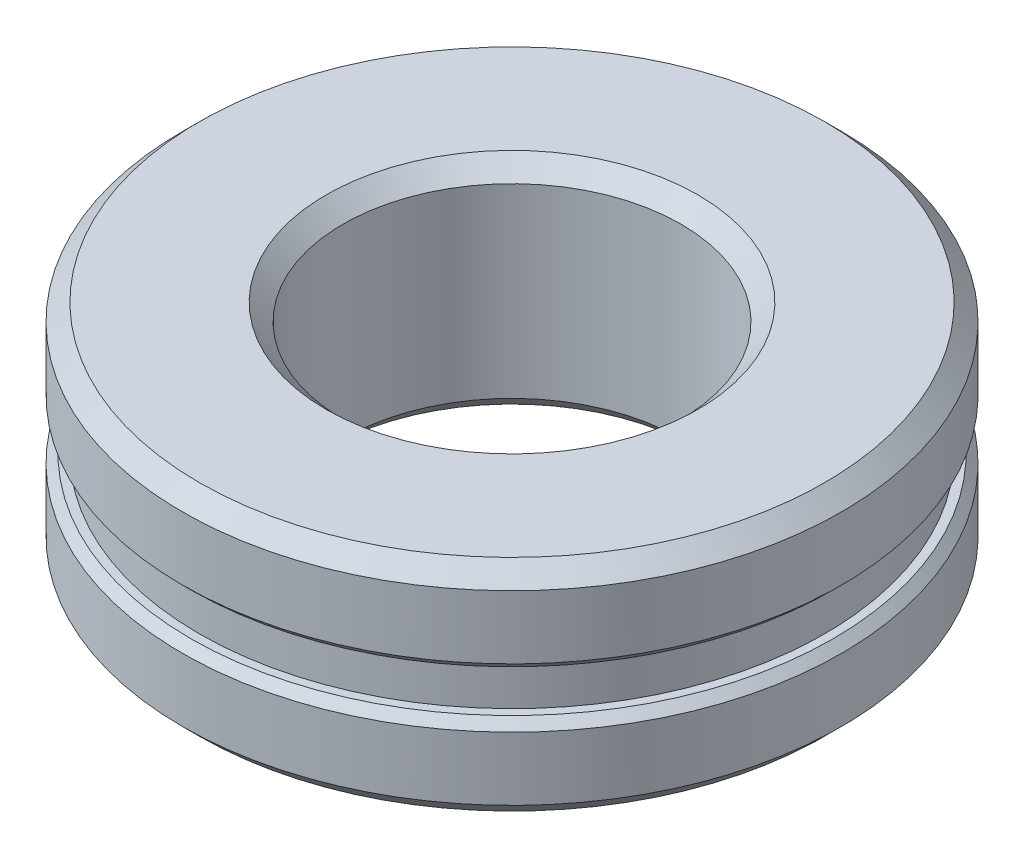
ISO-10303-21;
HEADER;
FILE_DESCRIPTION(('STEP AP214'),'2;1');
FILE_NAME('part.step','',(''),(''),'','','');
FILE_SCHEMA(('AUTOMOTIVE_DESIGN { 1 0 10303 214 1 1 1 1 }'));
ENDSEC;
DATA;
#1=APPLICATION_CONTEXT('core data for automotive mechanical design processes');
#2=APPLICATION_PROTOCOL_DEFINITION('international standard','automotive_design',2000,#1);
#3=PRODUCT_CONTEXT('',#1,'mechanical');
#4=PRODUCT('Part','Part','',(#3));
#5=PRODUCT_RELATED_PRODUCT_CATEGORY('part','',(#4));
#6=PRODUCT_DEFINITION_FORMATION('','',#4);
#7=PRODUCT_DEFINITION_CONTEXT('part definition',#1,'design');
#8=PRODUCT_DEFINITION('design','',#6,#7);
#9=PRODUCT_DEFINITION_SHAPE('','',#8);
#10=(LENGTH_UNIT() NAMED_UNIT(*) SI_UNIT(.MILLI.,.METRE.));
#11=(NAMED_UNIT(*) PLANE_ANGLE_UNIT() SI_UNIT($,.RADIAN.));
#12=(NAMED_UNIT(*) SI_UNIT($,.STERADIAN.) SOLID_ANGLE_UNIT());
#13=UNCERTAINTY_MEASURE_WITH_UNIT(LENGTH_MEASURE(1.E-05),#10,'distance_accuracy_value','');
#14=(GEOMETRIC_REPRESENTATION_CONTEXT(3) GLOBAL_UNCERTAINTY_ASSIGNED_CONTEXT((#13)) GLOBAL_UNIT_ASSIGNED_CONTEXT((#10,
#11,#12)) REPRESENTATION_CONTEXT('',''));
#15=CARTESIAN_POINT('',(0.,0.,0.));
#16=DIRECTION('',(0.,0.,1.));
#17=DIRECTION('',(1.,0.,0.));
#18=AXIS2_PLACEMENT_3D('',#15,#16,#17);
#19=CARTESIAN_POINT('',(0.,13.,0.));
#20=DIRECTION('',(0.,-1.,0.));
#21=DIRECTION('',(0.,0.,-1.));
#22=AXIS2_PLACEMENT_3D('',#19,#20,#21);
#23=CYLINDRICAL_SURFACE('',#22,39.);
#24=CARTESIAN_POINT('',(0.,-3.49999999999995,0.));
#25=DIRECTION('',(0.,1.,0.));
#26=DIRECTION('',(0.,0.,1.));
#27=AXIS2_PLACEMENT_3D('',#24,#25,#26);
#28=CIRCLE('',#27,39.);
#29=CARTESIAN_POINT('',(0.,-3.49999999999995,-39.));
#30=VERTEX_POINT('',#29);
#31=EDGE_CURVE('E10',#30,#30,#28,.F.);
#32=CARTESIAN_POINT('',(0.,-11.,0.));
#33=DIRECTION('',(0.,1.,0.));
#34=DIRECTION('',(0.,0.,1.));
#35=AXIS2_PLACEMENT_3D('',#32,#33,#34);
#36=CIRCLE('',#35,39.);
#37=CARTESIAN_POINT('',(0.,-11.,-39.));
#38=VERTEX_POINT('',#37);
#39=EDGE_CURVE('E57',#38,#38,#36,.T.);
#40=CARTESIAN_POINT('',(0.,-3.49999999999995,-39.));
#41=CARTESIAN_POINT('',(0.,-3.57812499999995,-39.));
#42=CARTESIAN_POINT('',(0.,-3.65624999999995,-39.));
#43=CARTESIAN_POINT('',(0.,-3.81249999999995,-39.));
#44=CARTESIAN_POINT('',(0.,-3.89062499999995,-39.));
#45=CARTESIAN_POINT('',(0.,-4.04687499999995,-39.));
#46=CARTESIAN_POINT('',(0.,-4.12499999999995,-39.));
#47=CARTESIAN_POINT('',(0.,-4.28124999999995,-39.));
#48=CARTESIAN_POINT('',(0.,-4.35937499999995,-39.));
#49=CARTESIAN_POINT('',(0.,-4.51562499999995,-39.));
#50=CARTESIAN_POINT('',(0.,-4.59374999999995,-39.));
#51=CARTESIAN_POINT('',(0.,-4.74999999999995,-39.));
#52=CARTESIAN_POINT('',(0.,-4.82812499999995,-39.));
#53=CARTESIAN_POINT('',(0.,-4.98437499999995,-39.));
#54=CARTESIAN_POINT('',(0.,-5.06249999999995,-39.));
#55=CARTESIAN_POINT('',(0.,-5.21874999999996,-39.));
#56=CARTESIAN_POINT('',(0.,-5.29687499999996,-39.));
#57=CARTESIAN_POINT('',(0.,-5.45312499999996,-39.));
#58=CARTESIAN_POINT('',(0.,-5.53124999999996,-39.));
#59=CARTESIAN_POINT('',(0.,-5.68749999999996,-39.));
#60=CARTESIAN_POINT('',(0.,-5.76562499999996,-39.));
#61=CARTESIAN_POINT('',(0.,-5.92187499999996,-39.));
#62=CARTESIAN_POINT('',(0.,-5.99999999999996,-39.));
#63=CARTESIAN_POINT('',(0.,-6.15624999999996,-39.));
#64=CARTESIAN_POINT('',(0.,-6.23437499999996,-39.));
#65=CARTESIAN_POINT('',(0.,-6.39062499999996,-39.));
#66=CARTESIAN_POINT('',(0.,-6.46874999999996,-39.));
#67=CARTESIAN_POINT('',(0.,-6.62499999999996,-39.));
#68=CARTESIAN_POINT('',(0.,-6.70312499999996,-39.));
#69=CARTESIAN_POINT('',(0.,-6.85937499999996,-39.));
#70=CARTESIAN_POINT('',(0.,-6.93749999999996,-39.));
#71=CARTESIAN_POINT('',(0.,-7.09374999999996,-39.));
#72=CARTESIAN_POINT('',(0.,-7.17187499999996,-39.));
#73=CARTESIAN_POINT('',(0.,-7.32812499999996,-39.));
#74=CARTESIAN_POINT('',(0.,-7.40624999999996,-39.));
#75=CARTESIAN_POINT('',(0.,-7.56249999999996,-39.));
#76=CARTESIAN_POINT('',(0.,-7.64062499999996,-39.));
#77=CARTESIAN_POINT('',(0.,-7.79687499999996,-39.));
#78=CARTESIAN_POINT('',(0.,-7.87499999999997,-39.));
#79=CARTESIAN_POINT('',(0.,-8.03124999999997,-39.));
#80=CARTESIAN_POINT('',(0.,-8.10937499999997,-39.));
#81=CARTESIAN_POINT('',(0.,-8.26562499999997,-39.));
#82=CARTESIAN_POINT('',(0.,-8.34374999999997,-39.));
#83=CARTESIAN_POINT('',(0.,-8.49999999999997,-39.));
#84=CARTESIAN_POINT('',(0.,-8.57812499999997,-39.));
#85=CARTESIAN_POINT('',(0.,-8.73437499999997,-39.));
#86=CARTESIAN_POINT('',(0.,-8.81249999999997,-39.));
#87=CARTESIAN_POINT('',(0.,-8.96874999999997,-39.));
#88=CARTESIAN_POINT('',(0.,-9.04687499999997,-39.));
#89=CARTESIAN_POINT('',(0.,-9.20312499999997,-39.));
#90=CARTESIAN_POINT('',(0.,-9.28124999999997,-39.));
#91=CARTESIAN_POINT('',(0.,-9.43749999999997,-39.));
#92=CARTESIAN_POINT('',(0.,-9.51562499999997,-39.));
#93=CARTESIAN_POINT('',(0.,-9.67187499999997,-39.));
#94=CARTESIAN_POINT('',(0.,-9.74999999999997,-39.));
#95=CARTESIAN_POINT('',(0.,-9.90624999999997,-39.));
#96=CARTESIAN_POINT('',(0.,-9.98437499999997,-39.));
#97=CARTESIAN_POINT('',(0.,-10.140625,-39.));
#98=CARTESIAN_POINT('',(0.,-10.21875,-39.));
#99=CARTESIAN_POINT('',(0.,-10.375,-39.));
#100=CARTESIAN_POINT('',(0.,-10.453125,-39.));
#101=CARTESIAN_POINT('',(0.,-10.609375,-39.));
#102=CARTESIAN_POINT('',(0.,-10.6875,-39.));
#103=CARTESIAN_POINT('',(0.,-10.84375,-39.));
#104=CARTESIAN_POINT('',(0.,-10.921875,-39.));
#105=CARTESIAN_POINT('',(0.,-11.,-39.));
#106=B_SPLINE_CURVE_WITH_KNOTS('',3,(#40,#41,#42,#43,#44,#45,#46,#47,#48,#49,#50,#51,#52,#53,
#54,#55,#56,#57,#58,#59,#60,#61,#62,#63,#64,#65,#66,#67,#68,#69,#70,#71,#72,#73,#74,#75,#76,#77,
#78,#79,#80,#81,#82,#83,#84,#85,#86,#87,#88,#89,#90,#91,#92,#93,#94,#95,#96,#97,#98,#99,#100,
#101,#102,#103,#104,#105),.UNSPECIFIED.,.F.,.F.,(4,2,2,2,2,2,2,2,2,2,2,2,2,2,2,2,2,2,2,2,2,2,2,
2,2,2,2,2,2,2,2,2,4),(0.,0.234375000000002,0.46875,0.703125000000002,0.937500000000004,1.171875,
1.40625,1.64062500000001,1.87500000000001,2.10937500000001,2.34375000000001,2.57812500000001,
2.81250000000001,3.04687500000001,3.28125000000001,3.51562500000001,3.75000000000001,
3.98437500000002,4.21875000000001,4.45312500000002,4.68750000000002,4.92187500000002,
5.15625000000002,5.39062500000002,5.62500000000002,5.85937500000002,6.09375000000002,
6.32812500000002,6.56250000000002,6.79687500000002,7.03125000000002,7.26562500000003,
7.50000000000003),.UNSPECIFIED.);
#107=EDGE_CURVE('BSEAM36',#30,#38,#106,.T.);
#108=ORIENTED_EDGE('',*,*,#31,.T.);
#109=ORIENTED_EDGE('',*,*,#39,.T.);
#110=ORIENTED_EDGE('',*,*,#107,.T.);
#111=ORIENTED_EDGE('',*,*,#107,.F.);
#112=EDGE_LOOP('',(#108,#110,#109,#111));
#113=FACE_BOUND('',#112,.T.);
#114=ADVANCED_FACE('F36',(#113),#23,.T.);
#115=CARTESIAN_POINT('',(0.,13.,0.));
#116=DIRECTION('',(0.,1.,0.));
#117=DIRECTION('',(0.,0.,1.));
#118=AXIS2_PLACEMENT_3D('',#115,#116,#117);
#119=PLANE('',#118);
#120=CARTESIAN_POINT('',(0.,13.,0.));
#121=DIRECTION('',(0.,1.,0.));
#122=DIRECTION('',(0.,0.,1.));
#123=AXIS2_PLACEMENT_3D('',#120,#121,#122);
#124=CIRCLE('',#123,22.);
#125=CARTESIAN_POINT('',(0.,13.,22.));
#126=VERTEX_POINT('',#125);
#127=EDGE_CURVE('E63',#126,#126,#124,.F.);
#128=ORIENTED_EDGE('',*,*,#127,.T.);
#129=EDGE_LOOP('',(#128));
#130=FACE_BOUND('',#129,.T.);
#131=CARTESIAN_POINT('',(0.,13.,0.));
#132=DIRECTION('',(0.,1.,0.));
#133=DIRECTION('',(0.,0.,1.));
#134=AXIS2_PLACEMENT_3D('',#131,#132,#133);
#135=CIRCLE('',#134,37.0000000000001);
#136=CARTESIAN_POINT('',(0.,13.,37.0000000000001));
#137=VERTEX_POINT('',#136);
#138=EDGE_CURVE('E66',#137,#137,#135,.T.);
#139=ORIENTED_EDGE('',*,*,#138,.T.);
#140=EDGE_LOOP('',(#139));
#141=FACE_BOUND('',#140,.T.);
#142=ADVANCED_FACE('F107',(#130,#141),#119,.T.);
#143=CARTESIAN_POINT('',(0.,-13.,0.));
#144=DIRECTION('',(0.,1.,0.));
#145=DIRECTION('',(0.,0.,1.));
#146=AXIS2_PLACEMENT_3D('',#143,#144,#145);
#147=PLANE('',#146);
#148=CARTESIAN_POINT('',(0.,-13.,0.));
#149=DIRECTION('',(0.,1.,0.));
#150=DIRECTION('',(0.,0.,1.));
#151=AXIS2_PLACEMENT_3D('',#148,#149,#150);
#152=CIRCLE('',#151,22.);
#153=CARTESIAN_POINT('',(0.,-13.,22.));
#154=VERTEX_POINT('',#153);
#155=EDGE_CURVE('E75',#154,#154,#152,.T.);
#156=ORIENTED_EDGE('',*,*,#155,.T.);
#157=EDGE_LOOP('',(#156));
#158=FACE_BOUND('',#157,.T.);
#159=CARTESIAN_POINT('',(0.,-13.,0.));
#160=DIRECTION('',(0.,1.,0.));
#161=DIRECTION('',(0.,0.,1.));
#162=AXIS2_PLACEMENT_3D('',#159,#160,#161);
#163=CIRCLE('',#162,37.);
#164=CARTESIAN_POINT('',(0.,-13.,37.));
#165=VERTEX_POINT('',#164);
#166=EDGE_CURVE('E78',#165,#165,#163,.F.);
#167=ORIENTED_EDGE('',*,*,#166,.T.);
#168=EDGE_LOOP('',(#167));
#169=FACE_BOUND('',#168,.T.);
#170=ADVANCED_FACE('F113',(#158,#169),#147,.F.);
#171=CARTESIAN_POINT('',(0.,3.50000000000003,0.));
#172=DIRECTION('',(0.,1.,0.));
#173=DIRECTION('',(0.,0.,1.));
#174=AXIS2_PLACEMENT_3D('',#171,#172,#173);
#175=CIRCLE('',#174,39.);
#176=CARTESIAN_POINT('',(0.,3.50000000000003,-39.));
#177=VERTEX_POINT('',#176);
#178=EDGE_CURVE('E52',#177,#177,#175,.T.);
#179=CARTESIAN_POINT('',(0.,11.,0.));
#180=DIRECTION('',(0.,1.,0.));
#181=DIRECTION('',(0.,0.,1.));
#182=AXIS2_PLACEMENT_3D('',#179,#180,#181);
#183=CIRCLE('',#182,39.);
#184=CARTESIAN_POINT('',(0.,11.,-39.));
#185=VERTEX_POINT('',#184);
#186=EDGE_CURVE('E60',#185,#185,#183,.F.);
#187=CARTESIAN_POINT('',(0.,3.50000000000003,-39.));
#188=CARTESIAN_POINT('',(0.,3.57812500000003,-39.));
#189=CARTESIAN_POINT('',(0.,3.65625000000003,-39.));
#190=CARTESIAN_POINT('',(0.,3.81250000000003,-39.));
#191=CARTESIAN_POINT('',(0.,3.89062500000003,-39.));
#192=CARTESIAN_POINT('',(0.,4.04687500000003,-39.));
#193=CARTESIAN_POINT('',(0.,4.12500000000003,-39.));
#194=CARTESIAN_POINT('',(0.,4.28125000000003,-39.));
#195=CARTESIAN_POINT('',(0.,4.35937500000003,-39.));
#196=CARTESIAN_POINT('',(0.,4.51562500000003,-39.));
#197=CARTESIAN_POINT('',(0.,4.59375000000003,-39.));
#198=CARTESIAN_POINT('',(0.,4.75000000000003,-39.));
#199=CARTESIAN_POINT('',(0.,4.82812500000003,-39.));
#200=CARTESIAN_POINT('',(0.,4.98437500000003,-39.));
#201=CARTESIAN_POINT('',(0.,5.06250000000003,-39.));
#202=CARTESIAN_POINT('',(0.,5.21875000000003,-39.));
#203=CARTESIAN_POINT('',(0.,5.29687500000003,-39.));
#204=CARTESIAN_POINT('',(0.,5.45312500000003,-39.));
#205=CARTESIAN_POINT('',(0.,5.53125000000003,-39.));
#206=CARTESIAN_POINT('',(0.,5.68750000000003,-39.));
#207=CARTESIAN_POINT('',(0.,5.76562500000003,-39.));
#208=CARTESIAN_POINT('',(0.,5.92187500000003,-39.));
#209=CARTESIAN_POINT('',(0.,6.00000000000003,-39.));
#210=CARTESIAN_POINT('',(0.,6.15625000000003,-39.));
#211=CARTESIAN_POINT('',(0.,6.23437500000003,-39.));
#212=CARTESIAN_POINT('',(0.,6.39062500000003,-39.));
#213=CARTESIAN_POINT('',(0.,6.46875000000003,-39.));
#214=CARTESIAN_POINT('',(0.,6.62500000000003,-39.));
#215=CARTESIAN_POINT('',(0.,6.70312500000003,-39.));
#216=CARTESIAN_POINT('',(0.,6.85937500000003,-39.));
#217=CARTESIAN_POINT('',(0.,6.93750000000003,-39.));
#218=CARTESIAN_POINT('',(0.,7.09375000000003,-39.));
#219=CARTESIAN_POINT('',(0.,7.17187500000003,-39.));
#220=CARTESIAN_POINT('',(0.,7.32812500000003,-39.));
#221=CARTESIAN_POINT('',(0.,7.40625000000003,-39.));
#222=CARTESIAN_POINT('',(0.,7.56250000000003,-39.));
#223=CARTESIAN_POINT('',(0.,7.64062500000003,-39.));
#224=CARTESIAN_POINT('',(0.,7.79687500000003,-39.));
#225=CARTESIAN_POINT('',(0.,7.87500000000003,-39.));
#226=CARTESIAN_POINT('',(0.,8.03125000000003,-39.));
#227=CARTESIAN_POINT('',(0.,8.10937500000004,-39.));
#228=CARTESIAN_POINT('',(0.,8.26562500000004,-39.));
#229=CARTESIAN_POINT('',(0.,8.34375000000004,-39.));
#230=CARTESIAN_POINT('',(0.,8.50000000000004,-39.));
#231=CARTESIAN_POINT('',(0.,8.57812500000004,-39.));
#232=CARTESIAN_POINT('',(0.,8.73437500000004,-39.));
#233=CARTESIAN_POINT('',(0.,8.81250000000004,-39.));
#234=CARTESIAN_POINT('',(0.,8.96875000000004,-39.));
#235=CARTESIAN_POINT('',(0.,9.04687500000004,-39.));
#236=CARTESIAN_POINT('',(0.,9.20312500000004,-39.));
#237=CARTESIAN_POINT('',(0.,9.28125000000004,-39.));
#238=CARTESIAN_POINT('',(0.,9.43750000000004,-39.));
#239=CARTESIAN_POINT('',(0.,9.51562500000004,-39.));
#240=CARTESIAN_POINT('',(0.,9.67187500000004,-39.));
#241=CARTESIAN_POINT('',(0.,9.75000000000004,-39.));
#242=CARTESIAN_POINT('',(0.,9.90625000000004,-39.));
#243=CARTESIAN_POINT('',(0.,9.98437500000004,-39.));
#244=CARTESIAN_POINT('',(0.,10.140625,-39.));
#245=CARTESIAN_POINT('',(0.,10.21875,-39.));
#246=CARTESIAN_POINT('',(0.,10.375,-39.));
#247=CARTESIAN_POINT('',(0.,10.453125,-39.));
#248=CARTESIAN_POINT('',(0.,10.609375,-39.));
#249=CARTESIAN_POINT('',(0.,10.6875,-39.));
#250=CARTESIAN_POINT('',(0.,10.84375,-39.));
#251=CARTESIAN_POINT('',(0.,10.921875,-39.));
#252=CARTESIAN_POINT('',(0.,11.,-39.));
#253=B_SPLINE_CURVE_WITH_KNOTS('',3,(#187,#188,#189,#190,#191,#192,#193,#194,#195,#196,#197,
#198,#199,#200,#201,#202,#203,#204,#205,#206,#207,#208,#209,#210,#211,#212,#213,#214,#215,#216,
#217,#218,#219,#220,#221,#222,#223,#224,#225,#226,#227,#228,#229,#230,#231,#232,#233,#234,#235,
#236,#237,#238,#239,#240,#241,#242,#243,#244,#245,#246,#247,#248,#249,#250,#251,#252),
.UNSPECIFIED.,.F.,.F.,(4,2,2,2,2,2,2,2,2,2,2,2,2,2,2,2,2,2,2,2,2,2,2,2,2,2,2,2,2,2,2,2,4),(0.,
0.234375,0.46875,0.703125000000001,0.937500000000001,1.171875,1.40625,1.640625,1.875,2.109375,
2.34375,2.578125,2.8125,3.046875,3.28125,3.51562500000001,3.75000000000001,3.98437500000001,
4.21875000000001,4.45312500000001,4.68750000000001,4.92187500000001,5.15625000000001,
5.39062500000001,5.62500000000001,5.85937500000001,6.09375000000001,6.32812500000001,
6.56250000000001,6.79687500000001,7.03125000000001,7.26562500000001,7.50000000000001),.UNSPECIFIED.);
#254=EDGE_CURVE('BSEAM109',#177,#185,#253,.T.);
#255=ORIENTED_EDGE('',*,*,#178,.T.);
#256=ORIENTED_EDGE('',*,*,#186,.T.);
#257=ORIENTED_EDGE('',*,*,#254,.T.);
#258=ORIENTED_EDGE('',*,*,#254,.F.);
#259=EDGE_LOOP('',(#255,#257,#256,#258));
#260=FACE_BOUND('',#259,.T.);
#261=ADVANCED_FACE('F109',(#260),#23,.T.);
#262=CARTESIAN_POINT('',(0.,13.,0.));
#263=DIRECTION('',(0.,-1.,0.));
#264=DIRECTION('',(0.,0.,-1.));
#265=AXIS2_PLACEMENT_3D('',#262,#263,#264);
#266=CYLINDRICAL_SURFACE('',#265,20.);
#267=CARTESIAN_POINT('',(0.,-11.,0.));
#268=DIRECTION('',(0.,1.,0.));
#269=DIRECTION('',(0.,0.,1.));
#270=AXIS2_PLACEMENT_3D('',#267,#268,#269);
#271=CIRCLE('',#270,20.);
#272=CARTESIAN_POINT('',(0.,-11.,-20.));
#273=VERTEX_POINT('',#272);
#274=EDGE_CURVE('E69',#273,#273,#271,.F.);
#275=CARTESIAN_POINT('',(0.,11.,0.));
#276=DIRECTION('',(0.,1.,0.));
#277=DIRECTION('',(0.,0.,1.));
#278=AXIS2_PLACEMENT_3D('',#275,#276,#277);
#279=CIRCLE('',#278,20.);
#280=CARTESIAN_POINT('',(0.,11.,-20.));
#281=VERTEX_POINT('',#280);
#282=EDGE_CURVE('E72',#281,#281,#279,.T.);
#283=CARTESIAN_POINT('',(0.,-11.,-20.));
#284=CARTESIAN_POINT('',(0.,-10.7708333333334,-20.));
#285=CARTESIAN_POINT('',(0.,-10.5416666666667,-20.));
#286=CARTESIAN_POINT('',(0.,-10.0833333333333,-20.));
#287=CARTESIAN_POINT('',(0.,-9.85416666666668,-20.));
#288=CARTESIAN_POINT('',(0.,-9.39583333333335,-20.));
#289=CARTESIAN_POINT('',(0.,-9.16666666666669,-20.));
#290=CARTESIAN_POINT('',(0.,-8.70833333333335,-20.));
#291=CARTESIAN_POINT('',(0.,-8.47916666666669,-20.));
#292=CARTESIAN_POINT('',(0.,-8.02083333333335,-20.));
#293=CARTESIAN_POINT('',(0.,-7.79166666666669,-20.));
#294=CARTESIAN_POINT('',(0.,-7.33333333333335,-20.));
#295=CARTESIAN_POINT('',(0.,-7.10416666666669,-20.));
#296=CARTESIAN_POINT('',(0.,-6.64583333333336,-20.));
#297=CARTESIAN_POINT('',(0.,-6.41666666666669,-20.));
#298=CARTESIAN_POINT('',(0.,-5.95833333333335,-20.));
#299=CARTESIAN_POINT('',(0.,-5.72916666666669,-20.));
#300=CARTESIAN_POINT('',(0.,-5.27083333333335,-20.));
#301=CARTESIAN_POINT('',(0.,-5.04166666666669,-20.));
#302=CARTESIAN_POINT('',(0.,-4.58333333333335,-20.));
#303=CARTESIAN_POINT('',(0.,-4.35416666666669,-20.));
#304=CARTESIAN_POINT('',(0.,-3.89583333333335,-20.));
#305=CARTESIAN_POINT('',(0.,-3.66666666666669,-20.));
#306=CARTESIAN_POINT('',(0.,-3.20833333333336,-20.));
#307=CARTESIAN_POINT('',(0.,-2.97916666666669,-20.));
#308=CARTESIAN_POINT('',(0.,-2.52083333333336,-20.));
#309=CARTESIAN_POINT('',(0.,-2.29166666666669,-20.));
#310=CARTESIAN_POINT('',(0.,-1.83333333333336,-20.));
#311=CARTESIAN_POINT('',(0.,-1.60416666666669,-20.));
#312=CARTESIAN_POINT('',(0.,-1.14583333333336,-20.));
#313=CARTESIAN_POINT('',(0.,-0.916666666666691,-20.));
#314=CARTESIAN_POINT('',(0.,-0.458333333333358,-20.));
#315=CARTESIAN_POINT('',(0.,-0.229166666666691,-20.));
#316=CARTESIAN_POINT('',(0.,0.229166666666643,-20.));
#317=CARTESIAN_POINT('',(0.,0.458333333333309,-20.));
#318=CARTESIAN_POINT('',(0.,0.916666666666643,-20.));
#319=CARTESIAN_POINT('',(0.,1.14583333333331,-20.));
#320=CARTESIAN_POINT('',(0.,1.60416666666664,-20.));
#321=CARTESIAN_POINT('',(0.,1.83333333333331,-20.));
#322=CARTESIAN_POINT('',(0.,2.29166666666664,-20.));
#323=CARTESIAN_POINT('',(0.,2.52083333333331,-20.));
#324=CARTESIAN_POINT('',(0.,2.97916666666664,-20.));
#325=CARTESIAN_POINT('',(0.,3.20833333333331,-20.));
#326=CARTESIAN_POINT('',(0.,3.66666666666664,-20.));
#327=CARTESIAN_POINT('',(0.,3.89583333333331,-20.));
#328=CARTESIAN_POINT('',(0.,4.35416666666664,-20.));
#329=CARTESIAN_POINT('',(0.,4.58333333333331,-20.));
#330=CARTESIAN_POINT('',(0.,5.04166666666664,-20.));
#331=CARTESIAN_POINT('',(0.,5.27083333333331,-20.));
#332=CARTESIAN_POINT('',(0.,5.72916666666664,-20.));
#333=CARTESIAN_POINT('',(0.,5.95833333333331,-20.));
#334=CARTESIAN_POINT('',(0.,6.41666666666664,-20.));
#335=CARTESIAN_POINT('',(0.,6.64583333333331,-20.));
#336=CARTESIAN_POINT('',(0.,7.10416666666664,-20.));
#337=CARTESIAN_POINT('',(0.,7.33333333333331,-20.));
#338=CARTESIAN_POINT('',(0.,7.79166666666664,-20.));
#339=CARTESIAN_POINT('',(0.,8.02083333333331,-20.));
#340=CARTESIAN_POINT('',(0.,8.47916666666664,-20.));
#341=CARTESIAN_POINT('',(0.,8.70833333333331,-20.));
#342=CARTESIAN_POINT('',(0.,9.16666666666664,-20.));
#343=CARTESIAN_POINT('',(0.,9.3958333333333,-20.));
#344=CARTESIAN_POINT('',(0.,9.85416666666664,-20.));
#345=CARTESIAN_POINT('',(0.,10.0833333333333,-20.));
#346=CARTESIAN_POINT('',(0.,10.5416666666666,-20.));
#347=CARTESIAN_POINT('',(0.,10.7708333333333,-20.));
#348=CARTESIAN_POINT('',(0.,11.,-20.));
#349=B_SPLINE_CURVE_WITH_KNOTS('',3,(#283,#284,#285,#286,#287,#288,#289,#290,#291,#292,#293,
#294,#295,#296,#297,#298,#299,#300,#301,#302,#303,#304,#305,#306,#307,#308,#309,#310,#311,#312,
#313,#314,#315,#316,#317,#318,#319,#320,#321,#322,#323,#324,#325,#326,#327,#328,#329,#330,#331,
#332,#333,#334,#335,#336,#337,#338,#339,#340,#341,#342,#343,#344,#345,#346,#347,#348),
.UNSPECIFIED.,.F.,.F.,(4,2,2,2,2,2,2,2,2,2,2,2,2,2,2,2,2,2,2,2,2,2,2,2,2,2,2,2,2,2,2,2,4),(0.,
0.687500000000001,1.375,2.0625,2.75,3.4375,4.125,4.8125,5.5,6.1875,6.875,7.5625,8.25,8.9375,
9.62499999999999,10.3125,11.,11.6875,12.375,13.0625,13.75,14.4375,15.125,15.8125,16.5,17.1875,
17.875,18.5625,19.25,19.9375,20.625,21.3125,22.),.UNSPECIFIED.);
#350=EDGE_CURVE('BSEAM120',#273,#281,#349,.T.);
#351=ORIENTED_EDGE('',*,*,#274,.T.);
#352=ORIENTED_EDGE('',*,*,#282,.T.);
#353=ORIENTED_EDGE('',*,*,#350,.T.);
#354=ORIENTED_EDGE('',*,*,#350,.F.);
#355=EDGE_LOOP('',(#351,#353,#352,#354));
#356=FACE_BOUND('',#355,.T.);
#357=ADVANCED_FACE('F120',(#356),#266,.F.);
#358=CARTESIAN_POINT('',(0.,-13.,0.));
#359=DIRECTION('',(0.,-1.,0.));
#360=DIRECTION('',(0.,0.,-1.));
#361=AXIS2_PLACEMENT_3D('',#358,#359,#360);
#362=CONICAL_SURFACE('',#361,22.,0.785398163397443);
#363=ORIENTED_EDGE('',*,*,#274,.F.);
#364=EDGE_LOOP('',(#363));
#365=FACE_BOUND('',#364,.T.);
#366=ORIENTED_EDGE('',*,*,#155,.F.);
#367=EDGE_LOOP('',(#366));
#368=FACE_BOUND('',#367,.T.);
#369=ADVANCED_FACE('F126',(#365,#368),#362,.F.);
#370=CARTESIAN_POINT('',(0.,11.,0.));
#371=DIRECTION('',(0.,1.,0.));
#372=DIRECTION('',(0.,0.,1.));
#373=AXIS2_PLACEMENT_3D('',#370,#371,#372);
#374=CONICAL_SURFACE('',#373,20.,0.785398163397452);
#375=ORIENTED_EDGE('',*,*,#127,.F.);
#376=EDGE_LOOP('',(#375));
#377=FACE_BOUND('',#376,.T.);
#378=ORIENTED_EDGE('',*,*,#282,.F.);
#379=EDGE_LOOP('',(#378));
#380=FACE_BOUND('',#379,.T.);
#381=ADVANCED_FACE('F159',(#377,#380),#374,.F.);
#382=CARTESIAN_POINT('',(0.,-11.,0.));
#383=DIRECTION('',(0.,1.,0.));
#384=DIRECTION('',(0.,0.,1.));
#385=AXIS2_PLACEMENT_3D('',#382,#383,#384);
#386=CONICAL_SURFACE('',#385,39.,0.78539816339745);
#387=ORIENTED_EDGE('',*,*,#166,.F.);
#388=EDGE_LOOP('',(#387));
#389=FACE_BOUND('',#388,.T.);
#390=ORIENTED_EDGE('',*,*,#39,.F.);
#391=EDGE_LOOP('',(#390));
#392=FACE_BOUND('',#391,.T.);
#393=ADVANCED_FACE('F102',(#389,#392),#386,.T.);
#394=CARTESIAN_POINT('',(0.,13.,0.));
#395=DIRECTION('',(0.,-1.,0.));
#396=DIRECTION('',(0.,0.,-1.));
#397=AXIS2_PLACEMENT_3D('',#394,#395,#396);
#398=CONICAL_SURFACE('',#397,37.0000000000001,0.785398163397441);
#399=ORIENTED_EDGE('',*,*,#186,.F.);
#400=EDGE_LOOP('',(#399));
#401=FACE_BOUND('',#400,.T.);
#402=ORIENTED_EDGE('',*,*,#138,.F.);
#403=EDGE_LOOP('',(#402));
#404=FACE_BOUND('',#403,.T.);
#405=ADVANCED_FACE('F94',(#401,#404),#398,.T.);
#406=CARTESIAN_POINT('',(0.,-2.5,0.));
#407=DIRECTION('',(0.,1.,0.));
#408=DIRECTION('',(0.,0.,1.));
#409=AXIS2_PLACEMENT_3D('',#406,#407,#408);
#410=PLANE('',#409);
#411=CARTESIAN_POINT('',(0.,-2.5,0.));
#412=DIRECTION('',(0.,1.,0.));
#413=DIRECTION('',(0.,0.,1.));
#414=AXIS2_PLACEMENT_3D('',#411,#412,#413);
#415=CIRCLE('',#414,38.0000000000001);
#416=CARTESIAN_POINT('',(0.,-2.5,38.0000000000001));
#417=VERTEX_POINT('',#416);
#418=EDGE_CURVE('E44',#417,#417,#415,.T.);
#419=ORIENTED_EDGE('',*,*,#418,.T.);
#420=EDGE_LOOP('',(#419));
#421=FACE_BOUND('',#420,.T.);
#422=CARTESIAN_POINT('',(0.,-2.5,0.));
#423=DIRECTION('',(0.,1.,0.));
#424=DIRECTION('',(0.,0.,1.));
#425=AXIS2_PLACEMENT_3D('',#422,#423,#424);
#426=CIRCLE('',#425,37.0000000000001);
#427=CARTESIAN_POINT('',(0.,-2.5,37.0000000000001));
#428=VERTEX_POINT('',#427);
#429=EDGE_CURVE('E81',#428,#428,#426,.T.);
#430=ORIENTED_EDGE('',*,*,#429,.F.);
#431=EDGE_LOOP('',(#430));
#432=FACE_BOUND('',#431,.T.);
#433=ADVANCED_FACE('F91',(#421,#432),#410,.T.);
#434=CARTESIAN_POINT('',(0.,2.5,0.));
#435=DIRECTION('',(0.,1.,0.));
#436=DIRECTION('',(0.,0.,1.));
#437=AXIS2_PLACEMENT_3D('',#434,#435,#436);
#438=PLANE('',#437);
#439=CARTESIAN_POINT('',(0.,2.5,0.));
#440=DIRECTION('',(0.,1.,0.));
#441=DIRECTION('',(0.,0.,1.));
#442=AXIS2_PLACEMENT_3D('',#439,#440,#441);
#443=CIRCLE('',#442,38.);
#444=CARTESIAN_POINT('',(0.,2.5,38.));
#445=VERTEX_POINT('',#444);
#446=EDGE_CURVE('E48',#445,#445,#443,.F.);
#447=ORIENTED_EDGE('',*,*,#446,.T.);
#448=EDGE_LOOP('',(#447));
#449=FACE_BOUND('',#448,.T.);
#450=CARTESIAN_POINT('',(0.,2.5,0.));
#451=DIRECTION('',(0.,1.,0.));
#452=DIRECTION('',(0.,0.,1.));
#453=AXIS2_PLACEMENT_3D('',#450,#451,#452);
#454=CIRCLE('',#453,37.0000000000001);
#455=CARTESIAN_POINT('',(0.,2.5,37.0000000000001));
#456=VERTEX_POINT('',#455);
#457=EDGE_CURVE('E82',#456,#456,#454,.T.);
#458=ORIENTED_EDGE('',*,*,#457,.T.);
#459=EDGE_LOOP('',(#458));
#460=FACE_BOUND('',#459,.T.);
#461=ADVANCED_FACE('F93',(#449,#460),#438,.F.);
#462=CARTESIAN_POINT('',(0.,-2.5,0.));
#463=DIRECTION('',(0.,1.,0.));
#464=DIRECTION('',(0.,0.,1.));
#465=AXIS2_PLACEMENT_3D('',#462,#463,#464);
#466=CYLINDRICAL_SURFACE('',#465,37.0000000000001);
#467=ORIENTED_EDGE('',*,*,#429,.T.);
#468=EDGE_LOOP('',(#467));
#469=FACE_BOUND('',#468,.T.);
#470=ORIENTED_EDGE('',*,*,#457,.F.);
#471=EDGE_LOOP('',(#470));
#472=FACE_BOUND('',#471,.T.);
#473=ADVANCED_FACE('F88',(#469,#472),#466,.T.);
#474=CARTESIAN_POINT('',(0.,3.50000000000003,0.));
#475=DIRECTION('',(0.,1.,0.));
#476=DIRECTION('',(0.,0.,1.));
#477=AXIS2_PLACEMENT_3D('',#474,#475,#476);
#478=CONICAL_SURFACE('',#477,39.,0.785398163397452);
#479=ORIENTED_EDGE('',*,*,#446,.F.);
#480=EDGE_LOOP('',(#479));
#481=FACE_BOUND('',#480,.T.);
#482=ORIENTED_EDGE('',*,*,#178,.F.);
#483=EDGE_LOOP('',(#482));
#484=FACE_BOUND('',#483,.T.);
#485=ADVANCED_FACE('F137',(#481,#484),#478,.T.);
#486=CARTESIAN_POINT('',(0.,-2.5,0.));
#487=DIRECTION('',(0.,-1.,0.));
#488=DIRECTION('',(0.,0.,-1.));
#489=AXIS2_PLACEMENT_3D('',#486,#487,#488);
#490=CONICAL_SURFACE('',#489,38.0000000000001,0.785398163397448);
#491=ORIENTED_EDGE('',*,*,#31,.F.);
#492=EDGE_LOOP('',(#491));
#493=FACE_BOUND('',#492,.T.);
#494=ORIENTED_EDGE('',*,*,#418,.F.);
#495=EDGE_LOOP('',(#494));
#496=FACE_BOUND('',#495,.T.);
#497=ADVANCED_FACE('F39',(#493,#496),#490,.T.);
#498=CLOSED_SHELL('',(#114,#142,#170,#261,#357,#369,#381,#393,#405,#433,#461,#473,#485,#497));
#499=MANIFOLD_SOLID_BREP('B2',#498);
#500=ADVANCED_BREP_SHAPE_REPRESENTATION('',(#18,#499),#14);
#501=SHAPE_DEFINITION_REPRESENTATION(#9,#500);
ENDSEC;
END-ISO-10303-21;
